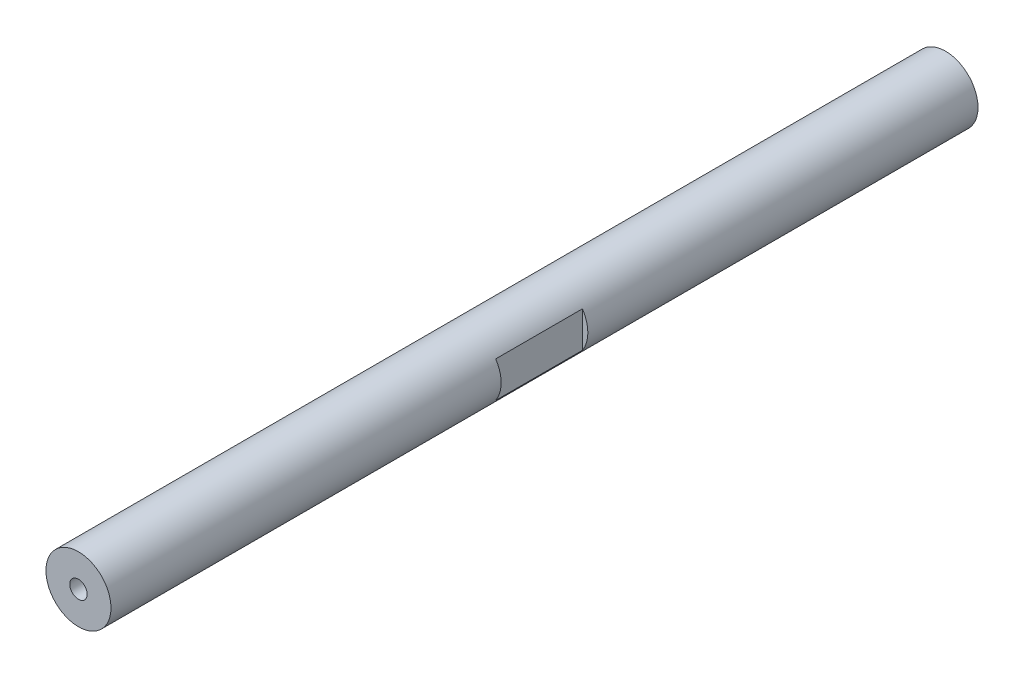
ISO-10303-21;
HEADER;
FILE_DESCRIPTION(('STEP AP214'),'2;1');
FILE_NAME('part.step','',(''),(''),'','','');
FILE_SCHEMA(('AUTOMOTIVE_DESIGN { 1 0 10303 214 1 1 1 1 }'));
ENDSEC;
DATA;
#1=APPLICATION_CONTEXT('core data for automotive mechanical design processes');
#2=APPLICATION_PROTOCOL_DEFINITION('international standard','automotive_design',2000,#1);
#3=PRODUCT_CONTEXT('',#1,'mechanical');
#4=PRODUCT('Part','Part','',(#3));
#5=PRODUCT_RELATED_PRODUCT_CATEGORY('part','',(#4));
#6=PRODUCT_DEFINITION_FORMATION('','',#4);
#7=PRODUCT_DEFINITION_CONTEXT('part definition',#1,'design');
#8=PRODUCT_DEFINITION('design','',#6,#7);
#9=PRODUCT_DEFINITION_SHAPE('','',#8);
#10=(LENGTH_UNIT() NAMED_UNIT(*) SI_UNIT(.MILLI.,.METRE.));
#11=(NAMED_UNIT(*) PLANE_ANGLE_UNIT() SI_UNIT($,.RADIAN.));
#12=(NAMED_UNIT(*) SI_UNIT($,.STERADIAN.) SOLID_ANGLE_UNIT());
#13=UNCERTAINTY_MEASURE_WITH_UNIT(LENGTH_MEASURE(1.E-05),#10,'distance_accuracy_value','');
#14=(GEOMETRIC_REPRESENTATION_CONTEXT(3) GLOBAL_UNCERTAINTY_ASSIGNED_CONTEXT((#13)) GLOBAL_UNIT_ASSIGNED_CONTEXT((#10,
#11,#12)) REPRESENTATION_CONTEXT('',''));
#15=CARTESIAN_POINT('',(0.,0.,0.));
#16=DIRECTION('',(0.,0.,1.));
#17=DIRECTION('',(1.,0.,0.));
#18=AXIS2_PLACEMENT_3D('',#15,#16,#17);
#19=CARTESIAN_POINT('',(0.,0.,127.));
#20=DIRECTION('',(0.,0.,-1.));
#21=DIRECTION('',(-1.,0.,0.));
#22=AXIS2_PLACEMENT_3D('',#19,#20,#21);
#23=CYLINDRICAL_SURFACE('',#22,9.525);
#24=DIRECTION('',(0.,0.,-1.));
#25=VECTOR('',#24,1.);
#26=CARTESIAN_POINT('',(7.9375,5.26514185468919,127.));
#27=LINE('',#26,#25);
#28=CARTESIAN_POINT('',(7.9375,5.26514185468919,12.7));
#29=VERTEX_POINT('',#28);
#30=CARTESIAN_POINT('',(7.9375,5.26514185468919,-12.7));
#31=VERTEX_POINT('',#30);
#32=EDGE_CURVE('E50',#29,#31,#27,.T.);
#33=ORIENTED_EDGE('',*,*,#32,.T.);
#34=CARTESIAN_POINT('',(0.,0.,-12.7));
#35=DIRECTION('',(0.,0.,-1.));
#36=DIRECTION('',(-1.,0.,0.));
#37=AXIS2_PLACEMENT_3D('',#34,#35,#36);
#38=CIRCLE('',#37,9.525);
#39=CARTESIAN_POINT('',(7.9375,-5.26514185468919,-12.7));
#40=VERTEX_POINT('',#39);
#41=EDGE_CURVE('E11',#31,#40,#38,.T.);
#42=ORIENTED_EDGE('',*,*,#41,.T.);
#43=DIRECTION('',(0.,0.,-1.));
#44=VECTOR('',#43,1.);
#45=CARTESIAN_POINT('',(7.9375,-5.26514185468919,127.));
#46=LINE('',#45,#44);
#47=CARTESIAN_POINT('',(7.9375,-5.26514185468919,12.7));
#48=VERTEX_POINT('',#47);
#49=EDGE_CURVE('E125',#40,#48,#46,.F.);
#50=ORIENTED_EDGE('',*,*,#49,.T.);
#51=CARTESIAN_POINT('',(0.,0.,12.7));
#52=DIRECTION('',(0.,0.,1.));
#53=DIRECTION('',(1.,0.,0.));
#54=AXIS2_PLACEMENT_3D('',#51,#52,#53);
#55=CIRCLE('',#54,9.525);
#56=EDGE_CURVE('E119',#48,#29,#55,.T.);
#57=ORIENTED_EDGE('',*,*,#56,.T.);
#58=EDGE_LOOP('',(#33,#42,#50,#57));
#59=FACE_BOUND('',#58,.T.);
#60=DIRECTION('',(0.,0.,-1.));
#61=VECTOR('',#60,1.);
#62=CARTESIAN_POINT('',(-7.93749999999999,5.26514185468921,127.));
#63=LINE('',#62,#61);
#64=CARTESIAN_POINT('',(-7.93749999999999,5.26514185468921,-12.7));
#65=VERTEX_POINT('',#64);
#66=CARTESIAN_POINT('',(-7.93749999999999,5.26514185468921,12.7));
#67=VERTEX_POINT('',#66);
#68=EDGE_CURVE('E101',#65,#67,#63,.F.);
#69=ORIENTED_EDGE('',*,*,#68,.T.);
#70=CARTESIAN_POINT('',(0.,0.,12.7));
#71=DIRECTION('',(0.,0.,1.));
#72=DIRECTION('',(1.,0.,0.));
#73=AXIS2_PLACEMENT_3D('',#70,#71,#72);
#74=CIRCLE('',#73,9.525);
#75=CARTESIAN_POINT('',(-7.93749999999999,-5.26514185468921,12.7));
#76=VERTEX_POINT('',#75);
#77=EDGE_CURVE('E114',#67,#76,#74,.T.);
#78=ORIENTED_EDGE('',*,*,#77,.T.);
#79=DIRECTION('',(0.,0.,-1.));
#80=VECTOR('',#79,1.);
#81=CARTESIAN_POINT('',(-7.93749999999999,-5.26514185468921,127.));
#82=LINE('',#81,#80);
#83=CARTESIAN_POINT('',(-7.93749999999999,-5.26514185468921,-12.7));
#84=VERTEX_POINT('',#83);
#85=EDGE_CURVE('E107',#76,#84,#82,.T.);
#86=ORIENTED_EDGE('',*,*,#85,.T.);
#87=CARTESIAN_POINT('',(0.,0.,-12.7));
#88=DIRECTION('',(0.,0.,-1.));
#89=DIRECTION('',(-1.,0.,0.));
#90=AXIS2_PLACEMENT_3D('',#87,#88,#89);
#91=CIRCLE('',#90,9.525);
#92=EDGE_CURVE('E92',#84,#65,#91,.T.);
#93=ORIENTED_EDGE('',*,*,#92,.T.);
#94=EDGE_LOOP('',(#69,#78,#86,#93));
#95=FACE_BOUND('',#94,.T.);
#96=CARTESIAN_POINT('',(0.,0.,127.));
#97=DIRECTION('',(0.,0.,1.));
#98=DIRECTION('',(1.,0.,0.));
#99=AXIS2_PLACEMENT_3D('',#96,#97,#98);
#100=CIRCLE('',#99,9.525);
#101=CARTESIAN_POINT('',(9.525,0.,127.));
#102=VERTEX_POINT('',#101);
#103=EDGE_CURVE('E102',#102,#102,#100,.T.);
#104=ORIENTED_EDGE('',*,*,#103,.F.);
#105=EDGE_LOOP('',(#104));
#106=FACE_BOUND('',#105,.T.);
#107=CARTESIAN_POINT('',(0.,0.,-127.));
#108=DIRECTION('',(0.,0.,1.));
#109=DIRECTION('',(1.,0.,0.));
#110=AXIS2_PLACEMENT_3D('',#107,#108,#109);
#111=CIRCLE('',#110,9.525);
#112=CARTESIAN_POINT('',(9.525,0.,-127.));
#113=VERTEX_POINT('',#112);
#114=EDGE_CURVE('E165',#113,#113,#111,.T.);
#115=ORIENTED_EDGE('',*,*,#114,.T.);
#116=EDGE_LOOP('',(#115));
#117=FACE_BOUND('',#116,.T.);
#118=ADVANCED_FACE('F42',(#59,#95,#106,#117),#23,.T.);
#119=CARTESIAN_POINT('',(0.,0.,127.));
#120=DIRECTION('',(0.,0.,1.));
#121=DIRECTION('',(1.,0.,0.));
#122=AXIS2_PLACEMENT_3D('',#119,#120,#121);
#123=PLANE('',#122);
#124=CARTESIAN_POINT('',(0.,0.,127.));
#125=DIRECTION('',(0.,0.,1.));
#126=DIRECTION('',(1.,0.,0.));
#127=AXIS2_PLACEMENT_3D('',#124,#125,#126);
#128=CIRCLE('',#127,2.55269999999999);
#129=CARTESIAN_POINT('',(2.55269999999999,0.,127.));
#130=VERTEX_POINT('',#129);
#131=EDGE_CURVE('E157',#130,#130,#128,.T.);
#132=ORIENTED_EDGE('',*,*,#131,.F.);
#133=EDGE_LOOP('',(#132));
#134=FACE_BOUND('',#133,.T.);
#135=ORIENTED_EDGE('',*,*,#103,.T.);
#136=EDGE_LOOP('',(#135));
#137=FACE_BOUND('',#136,.T.);
#138=ADVANCED_FACE('F177',(#134,#137),#123,.T.);
#139=CARTESIAN_POINT('',(0.,0.,-127.));
#140=DIRECTION('',(0.,0.,1.));
#141=DIRECTION('',(1.,0.,0.));
#142=AXIS2_PLACEMENT_3D('',#139,#140,#141);
#143=PLANE('',#142);
#144=CARTESIAN_POINT('',(0.,0.,-127.));
#145=DIRECTION('',(0.,0.,-1.));
#146=DIRECTION('',(-1.,0.,0.));
#147=AXIS2_PLACEMENT_3D('',#144,#145,#146);
#148=CIRCLE('',#147,2.55269999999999);
#149=CARTESIAN_POINT('',(-2.55269999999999,0.,-127.));
#150=VERTEX_POINT('',#149);
#151=EDGE_CURVE('E146',#150,#150,#148,.T.);
#152=ORIENTED_EDGE('',*,*,#151,.F.);
#153=EDGE_LOOP('',(#152));
#154=FACE_BOUND('',#153,.T.);
#155=ORIENTED_EDGE('',*,*,#114,.F.);
#156=EDGE_LOOP('',(#155));
#157=FACE_BOUND('',#156,.T.);
#158=ADVANCED_FACE('F174',(#154,#157),#143,.F.);
#159=CARTESIAN_POINT('',(0.,0.,95.25));
#160=DIRECTION('',(0.,0.,1.));
#161=DIRECTION('',(1.,0.,0.));
#162=AXIS2_PLACEMENT_3D('',#159,#160,#161);
#163=CONICAL_SURFACE('',#162,2.55269999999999,1.02974425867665);
#164=CARTESIAN_POINT('',(0.,0.,93.7161830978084));
#165=VERTEX_POINT('',#164);
#166=VERTEX_LOOP('',#165);
#167=FACE_BOUND('',#166,.T.);
#168=CARTESIAN_POINT('',(0.,0.,95.25));
#169=DIRECTION('',(0.,0.,1.));
#170=DIRECTION('',(1.,0.,0.));
#171=AXIS2_PLACEMENT_3D('',#168,#169,#170);
#172=CIRCLE('',#171,2.55269999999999);
#173=CARTESIAN_POINT('',(2.55269999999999,0.,95.25));
#174=VERTEX_POINT('',#173);
#175=EDGE_CURVE('E161',#174,#174,#172,.T.);
#176=ORIENTED_EDGE('',*,*,#175,.T.);
#177=EDGE_LOOP('',(#176));
#178=FACE_BOUND('',#177,.T.);
#179=ADVANCED_FACE('F176',(#167,#178),#163,.F.);
#180=CARTESIAN_POINT('',(0.,0.,127.));
#181=DIRECTION('',(0.,0.,1.));
#182=DIRECTION('',(1.,0.,0.));
#183=AXIS2_PLACEMENT_3D('',#180,#181,#182);
#184=CYLINDRICAL_SURFACE('',#183,2.55269999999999);
#185=ORIENTED_EDGE('',*,*,#175,.F.);
#186=EDGE_LOOP('',(#185));
#187=FACE_BOUND('',#186,.T.);
#188=ORIENTED_EDGE('',*,*,#131,.T.);
#189=EDGE_LOOP('',(#188));
#190=FACE_BOUND('',#189,.T.);
#191=ADVANCED_FACE('F183',(#187,#190),#184,.F.);
#192=CARTESIAN_POINT('',(0.,0.,-95.25));
#193=DIRECTION('',(0.,0.,-1.));
#194=DIRECTION('',(-1.,0.,0.));
#195=AXIS2_PLACEMENT_3D('',#192,#193,#194);
#196=CONICAL_SURFACE('',#195,2.55269999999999,1.02974425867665);
#197=CARTESIAN_POINT('',(0.,0.,-93.7161830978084));
#198=VERTEX_POINT('',#197);
#199=VERTEX_LOOP('',#198);
#200=FACE_BOUND('',#199,.T.);
#201=CARTESIAN_POINT('',(0.,0.,-95.25));
#202=DIRECTION('',(0.,0.,-1.));
#203=DIRECTION('',(-1.,0.,0.));
#204=AXIS2_PLACEMENT_3D('',#201,#202,#203);
#205=CIRCLE('',#204,2.55269999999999);
#206=CARTESIAN_POINT('',(-2.55269999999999,0.,-95.25));
#207=VERTEX_POINT('',#206);
#208=EDGE_CURVE('E153',#207,#207,#205,.T.);
#209=ORIENTED_EDGE('',*,*,#208,.T.);
#210=EDGE_LOOP('',(#209));
#211=FACE_BOUND('',#210,.T.);
#212=ADVANCED_FACE('F213',(#200,#211),#196,.F.);
#213=CARTESIAN_POINT('',(0.,0.,-127.));
#214=DIRECTION('',(0.,0.,-1.));
#215=DIRECTION('',(-1.,0.,0.));
#216=AXIS2_PLACEMENT_3D('',#213,#214,#215);
#217=CYLINDRICAL_SURFACE('',#216,2.55269999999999);
#218=ORIENTED_EDGE('',*,*,#208,.F.);
#219=EDGE_LOOP('',(#218));
#220=FACE_BOUND('',#219,.T.);
#221=ORIENTED_EDGE('',*,*,#151,.T.);
#222=EDGE_LOOP('',(#221));
#223=FACE_BOUND('',#222,.T.);
#224=ADVANCED_FACE('F230',(#220,#223),#217,.F.);
#225=CARTESIAN_POINT('',(-7.93749999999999,-9.525,12.7));
#226=DIRECTION('',(1.,0.,0.));
#227=DIRECTION('',(0.,0.,-1.));
#228=AXIS2_PLACEMENT_3D('',#225,#226,#227);
#229=PLANE('',#228);
#230=DIRECTION('',(0.,1.,0.));
#231=VECTOR('',#230,1.);
#232=CARTESIAN_POINT('',(-7.93749999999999,-9.525,12.7));
#233=LINE('',#232,#231);
#234=EDGE_CURVE('E110',#76,#67,#233,.T.);
#235=ORIENTED_EDGE('',*,*,#234,.T.);
#236=ORIENTED_EDGE('',*,*,#68,.F.);
#237=DIRECTION('',(0.,1.,0.));
#238=VECTOR('',#237,1.);
#239=CARTESIAN_POINT('',(-7.93749999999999,-9.525,-12.7));
#240=LINE('',#239,#238);
#241=EDGE_CURVE('E95',#84,#65,#240,.T.);
#242=ORIENTED_EDGE('',*,*,#241,.F.);
#243=ORIENTED_EDGE('',*,*,#85,.F.);
#244=EDGE_LOOP('',(#235,#236,#242,#243));
#245=FACE_BOUND('',#244,.T.);
#246=ADVANCED_FACE('F106',(#245),#229,.F.);
#247=CARTESIAN_POINT('',(-7.93749999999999,-9.525,12.7));
#248=DIRECTION('',(0.,0.,1.));
#249=DIRECTION('',(1.,0.,0.));
#250=AXIS2_PLACEMENT_3D('',#247,#248,#249);
#251=PLANE('',#250);
#252=ORIENTED_EDGE('',*,*,#234,.F.);
#253=ORIENTED_EDGE('',*,*,#77,.F.);
#254=EDGE_LOOP('',(#252,#253));
#255=FACE_BOUND('',#254,.T.);
#256=ADVANCED_FACE('F252',(#255),#251,.F.);
#257=CARTESIAN_POINT('',(-7.93749999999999,-9.525,-12.7));
#258=DIRECTION('',(0.,0.,-1.));
#259=DIRECTION('',(-1.,0.,0.));
#260=AXIS2_PLACEMENT_3D('',#257,#258,#259);
#261=PLANE('',#260);
#262=ORIENTED_EDGE('',*,*,#92,.F.);
#263=ORIENTED_EDGE('',*,*,#241,.T.);
#264=EDGE_LOOP('',(#262,#263));
#265=FACE_BOUND('',#264,.T.);
#266=ADVANCED_FACE('F94',(#265),#261,.F.);
#267=CARTESIAN_POINT('',(7.93750000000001,-9.525,12.7));
#268=DIRECTION('',(-1.,0.,0.));
#269=DIRECTION('',(0.,0.,1.));
#270=AXIS2_PLACEMENT_3D('',#267,#268,#269);
#271=PLANE('',#270);
#272=DIRECTION('',(0.,1.,0.));
#273=VECTOR('',#272,1.);
#274=CARTESIAN_POINT('',(7.93750000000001,-9.525,12.7));
#275=LINE('',#274,#273);
#276=EDGE_CURVE('E137',#48,#29,#275,.T.);
#277=ORIENTED_EDGE('',*,*,#276,.F.);
#278=ORIENTED_EDGE('',*,*,#49,.F.);
#279=DIRECTION('',(0.,1.,0.));
#280=VECTOR('',#279,1.);
#281=CARTESIAN_POINT('',(7.93750000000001,-9.525,-12.7));
#282=LINE('',#281,#280);
#283=EDGE_CURVE('E139',#40,#31,#282,.T.);
#284=ORIENTED_EDGE('',*,*,#283,.T.);
#285=ORIENTED_EDGE('',*,*,#32,.F.);
#286=EDGE_LOOP('',(#277,#278,#284,#285));
#287=FACE_BOUND('',#286,.T.);
#288=ADVANCED_FACE('F136',(#287),#271,.F.);
#289=CARTESIAN_POINT('',(7.93750000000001,-9.525,-12.7));
#290=DIRECTION('',(0.,0.,-1.));
#291=DIRECTION('',(-1.,0.,0.));
#292=AXIS2_PLACEMENT_3D('',#289,#290,#291);
#293=PLANE('',#292);
#294=ORIENTED_EDGE('',*,*,#283,.F.);
#295=ORIENTED_EDGE('',*,*,#41,.F.);
#296=EDGE_LOOP('',(#294,#295));
#297=FACE_BOUND('',#296,.T.);
#298=ADVANCED_FACE('F279',(#297),#293,.F.);
#299=CARTESIAN_POINT('',(7.93750000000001,-9.525,12.7));
#300=DIRECTION('',(0.,0.,1.));
#301=DIRECTION('',(1.,0.,0.));
#302=AXIS2_PLACEMENT_3D('',#299,#300,#301);
#303=PLANE('',#302);
#304=ORIENTED_EDGE('',*,*,#56,.F.);
#305=ORIENTED_EDGE('',*,*,#276,.T.);
#306=EDGE_LOOP('',(#304,#305));
#307=FACE_BOUND('',#306,.T.);
#308=ADVANCED_FACE('F141',(#307),#303,.F.);
#309=CLOSED_SHELL('',(#118,#138,#158,#179,#191,#212,#224,#246,#256,#266,#288,#298,#308));
#310=MANIFOLD_SOLID_BREP('B2',#309);
#311=ADVANCED_BREP_SHAPE_REPRESENTATION('',(#18,#310),#14);
#312=SHAPE_DEFINITION_REPRESENTATION(#9,#311);
ENDSEC;
END-ISO-10303-21;
